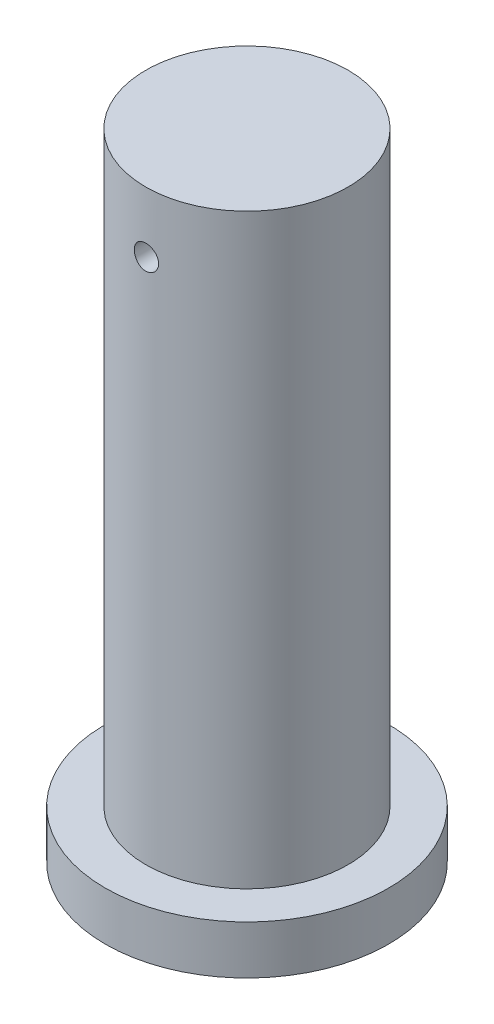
ISO-10303-21;
HEADER;
FILE_DESCRIPTION(('STEP AP214'),'2;1');
FILE_NAME('part.step','',(''),(''),'','','');
FILE_SCHEMA(('AUTOMOTIVE_DESIGN { 1 0 10303 214 1 1 1 1 }'));
ENDSEC;
DATA;
#1=APPLICATION_CONTEXT('core data for automotive mechanical design processes');
#2=APPLICATION_PROTOCOL_DEFINITION('international standard','automotive_design',2000,#1);
#3=PRODUCT_CONTEXT('',#1,'mechanical');
#4=PRODUCT('Part','Part','',(#3));
#5=PRODUCT_RELATED_PRODUCT_CATEGORY('part','',(#4));
#6=PRODUCT_DEFINITION_FORMATION('','',#4);
#7=PRODUCT_DEFINITION_CONTEXT('part definition',#1,'design');
#8=PRODUCT_DEFINITION('design','',#6,#7);
#9=PRODUCT_DEFINITION_SHAPE('','',#8);
#10=(LENGTH_UNIT() NAMED_UNIT(*) SI_UNIT(.MILLI.,.METRE.));
#11=(NAMED_UNIT(*) PLANE_ANGLE_UNIT() SI_UNIT($,.RADIAN.));
#12=(NAMED_UNIT(*) SI_UNIT($,.STERADIAN.) SOLID_ANGLE_UNIT());
#13=UNCERTAINTY_MEASURE_WITH_UNIT(LENGTH_MEASURE(1.E-05),#10,'distance_accuracy_value','');
#14=(GEOMETRIC_REPRESENTATION_CONTEXT(3) GLOBAL_UNCERTAINTY_ASSIGNED_CONTEXT((#13)) GLOBAL_UNIT_ASSIGNED_CONTEXT((#10,
#11,#12)) REPRESENTATION_CONTEXT('',''));
#15=CARTESIAN_POINT('',(0.,0.,0.));
#16=DIRECTION('',(0.,0.,1.));
#17=DIRECTION('',(1.,0.,0.));
#18=AXIS2_PLACEMENT_3D('',#15,#16,#17);
#19=CARTESIAN_POINT('',(0.,0.,25.));
#20=DIRECTION('',(0.,1.,0.));
#21=DIRECTION('',(0.,0.,1.));
#22=AXIS2_PLACEMENT_3D('',#19,#20,#21);
#23=PLANE('',#22);
#24=CARTESIAN_POINT('',(0.,0.,0.));
#25=DIRECTION('',(0.,1.,0.));
#26=DIRECTION('',(0.,0.,1.));
#27=AXIS2_PLACEMENT_3D('',#24,#25,#26);
#28=CIRCLE('',#27,25.);
#29=CARTESIAN_POINT('',(0.,0.,25.));
#30=VERTEX_POINT('',#29);
#31=EDGE_CURVE('E91',#30,#30,#28,.T.);
#32=ORIENTED_EDGE('',*,*,#31,.T.);
#33=EDGE_LOOP('',(#32));
#34=FACE_BOUND('',#33,.T.);
#35=ADVANCED_FACE('F41',(#34),#23,.T.);
#36=CARTESIAN_POINT('',(0.,-157.,0.));
#37=DIRECTION('',(0.,-1.,0.));
#38=DIRECTION('',(0.,0.,-1.));
#39=AXIS2_PLACEMENT_3D('',#36,#37,#38);
#40=PLANE('',#39);
#41=CARTESIAN_POINT('',(0.,-157.,0.));
#42=DIRECTION('',(0.,1.,0.));
#43=DIRECTION('',(0.,0.,1.));
#44=AXIS2_PLACEMENT_3D('',#41,#42,#43);
#45=CIRCLE('',#44,35.);
#46=CARTESIAN_POINT('',(0.,-157.,35.));
#47=VERTEX_POINT('',#46);
#48=EDGE_CURVE('E10',#47,#47,#45,.T.);
#49=ORIENTED_EDGE('',*,*,#48,.F.);
#50=EDGE_LOOP('',(#49));
#51=FACE_BOUND('',#50,.T.);
#52=ADVANCED_FACE('F82',(#51),#40,.T.);
#53=CARTESIAN_POINT('',(0.,0.,0.));
#54=DIRECTION('',(0.,1.,0.));
#55=DIRECTION('',(0.,0.,1.));
#56=AXIS2_PLACEMENT_3D('',#53,#54,#55);
#57=CYLINDRICAL_SURFACE('',#56,35.);
#58=ORIENTED_EDGE('',*,*,#48,.T.);
#59=EDGE_LOOP('',(#58));
#60=FACE_BOUND('',#59,.T.);
#61=CARTESIAN_POINT('',(0.,-145.,0.));
#62=DIRECTION('',(0.,1.,0.));
#63=DIRECTION('',(0.,0.,1.));
#64=AXIS2_PLACEMENT_3D('',#61,#62,#63);
#65=CIRCLE('',#64,35.);
#66=CARTESIAN_POINT('',(0.,-145.,35.));
#67=VERTEX_POINT('',#66);
#68=EDGE_CURVE('E53',#67,#67,#65,.T.);
#69=ORIENTED_EDGE('',*,*,#68,.F.);
#70=EDGE_LOOP('',(#69));
#71=FACE_BOUND('',#70,.T.);
#72=ADVANCED_FACE('F87',(#60,#71),#57,.T.);
#73=CARTESIAN_POINT('',(0.,-145.,35.));
#74=DIRECTION('',(0.,1.,0.));
#75=DIRECTION('',(0.,0.,1.));
#76=AXIS2_PLACEMENT_3D('',#73,#74,#75);
#77=PLANE('',#76);
#78=ORIENTED_EDGE('',*,*,#68,.T.);
#79=EDGE_LOOP('',(#78));
#80=FACE_BOUND('',#79,.T.);
#81=CARTESIAN_POINT('',(0.,-145.,0.));
#82=DIRECTION('',(0.,1.,0.));
#83=DIRECTION('',(0.,0.,1.));
#84=AXIS2_PLACEMENT_3D('',#81,#82,#83);
#85=CIRCLE('',#84,25.);
#86=CARTESIAN_POINT('',(0.,-145.,25.));
#87=VERTEX_POINT('',#86);
#88=EDGE_CURVE('E58',#87,#87,#85,.T.);
#89=ORIENTED_EDGE('',*,*,#88,.F.);
#90=EDGE_LOOP('',(#89));
#91=FACE_BOUND('',#90,.T.);
#92=ADVANCED_FACE('F77',(#80,#91),#77,.T.);
#93=CARTESIAN_POINT('',(0.,0.,0.));
#94=DIRECTION('',(0.,1.,0.));
#95=DIRECTION('',(0.,0.,1.));
#96=AXIS2_PLACEMENT_3D('',#93,#94,#95);
#97=CYLINDRICAL_SURFACE('',#96,25.);
#98=CARTESIAN_POINT('',(0.,-18.,25.));
#99=CARTESIAN_POINT('',(0.1678640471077,-17.9999928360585,24.9999977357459));
#100=CARTESIAN_POINT('',(0.335834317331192,-17.9858633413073,24.9982914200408));
#101=CARTESIAN_POINT('',(0.66710457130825,-17.9297189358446,24.991648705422));
#102=CARTESIAN_POINT('',(0.830399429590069,-17.8876745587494,24.9867088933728));
#103=CARTESIAN_POINT('',(1.14747479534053,-17.7769537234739,24.9741559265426));
#104=CARTESIAN_POINT('',(1.30126148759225,-17.7082947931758,24.9665445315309));
#105=CARTESIAN_POINT('',(1.595099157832,-17.5463312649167,24.9494959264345));
#106=CARTESIAN_POINT('',(1.73515256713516,-17.4530310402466,24.9400590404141));
#107=CARTESIAN_POINT('',(1.99829131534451,-17.2439251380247,24.920360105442));
#108=CARTESIAN_POINT('',(2.1212966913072,-17.128019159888,24.9100945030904));
#109=CARTESIAN_POINT('',(2.34615931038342,-16.8772070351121,24.8899239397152));
#110=CARTESIAN_POINT('',(2.44801549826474,-16.7422999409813,24.8800189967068));
#111=CARTESIAN_POINT('',(2.62798342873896,-16.4567991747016,24.8616560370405));
#112=CARTESIAN_POINT('',(2.7060207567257,-16.3061582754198,24.8532025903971));
#113=CARTESIAN_POINT('',(2.8356605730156,-15.9937912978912,24.8387461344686));
#114=CARTESIAN_POINT('',(2.88726398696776,-15.8320656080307,24.8327430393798));
#115=CARTESIAN_POINT('',(2.962329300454,-15.5029471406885,24.8239006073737));
#116=CARTESIAN_POINT('',(2.98592577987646,-15.3355854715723,24.8210461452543));
#117=CARTESIAN_POINT('',(3.0047237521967,-14.9992550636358,24.8187777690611));
#118=CARTESIAN_POINT('',(2.99992630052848,-14.830286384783,24.8193637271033));
#119=CARTESIAN_POINT('',(2.96218316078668,-14.4964740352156,24.8238961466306));
#120=CARTESIAN_POINT('',(2.92938543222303,-14.3316133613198,24.8278249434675));
#121=CARTESIAN_POINT('',(2.83680346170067,-14.0097529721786,24.8385728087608));
#122=CARTESIAN_POINT('',(2.77701871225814,-13.852753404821,24.8453919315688));
#123=CARTESIAN_POINT('',(2.63199980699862,-13.5506105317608,24.8611722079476));
#124=CARTESIAN_POINT('',(2.54670106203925,-13.4054985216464,24.8701387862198));
#125=CARTESIAN_POINT('',(2.35312173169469,-13.1315927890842,24.8891993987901));
#126=CARTESIAN_POINT('',(2.24484017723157,-13.0027997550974,24.8992934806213));
#127=CARTESIAN_POINT('',(2.0075475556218,-12.7643289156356,24.9195503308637));
#128=CARTESIAN_POINT('',(1.87840890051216,-12.6547780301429,24.929713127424));
#129=CARTESIAN_POINT('',(1.60350795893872,-12.4588884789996,24.9489020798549));
#130=CARTESIAN_POINT('',(1.45774563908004,-12.3725498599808,24.9579282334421));
#131=CARTESIAN_POINT('',(1.15363930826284,-12.2255367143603,24.9738318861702));
#132=CARTESIAN_POINT('',(0.995291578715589,-12.1648698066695,24.9807087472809));
#133=CARTESIAN_POINT('',(0.670556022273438,-12.0710212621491,24.991533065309));
#134=CARTESIAN_POINT('',(0.504168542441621,-12.0378384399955,24.9954806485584));
#135=CARTESIAN_POINT('',(0.169174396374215,-12.0000637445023,24.9999852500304));
#136=CARTESIAN_POINT('',(0.000587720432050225,-11.9952969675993,25.0005630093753));
#137=CARTESIAN_POINT('',(-0.334982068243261,-12.0140285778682,24.9983187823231));
#138=CARTESIAN_POINT('',(-0.50196521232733,-12.0375264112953,24.9954968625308));
#139=CARTESIAN_POINT('',(-0.829074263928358,-12.111974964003,24.9867833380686));
#140=CARTESIAN_POINT('',(-0.989219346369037,-12.16284261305,24.9809010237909));
#141=CARTESIAN_POINT('',(-1.29870539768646,-12.2905007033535,24.9667255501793));
#142=CARTESIAN_POINT('',(-1.44804602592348,-12.36729196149,24.9584323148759));
#143=CARTESIAN_POINT('',(-1.73246717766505,-12.5450429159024,24.9403085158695));
#144=CARTESIAN_POINT('',(-1.86747628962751,-12.6461161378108,24.9304708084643));
#145=CARTESIAN_POINT('',(-2.11867625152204,-12.8694008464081,24.9103817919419));
#146=CARTESIAN_POINT('',(-2.23486641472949,-12.9916131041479,24.9001304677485));
#147=CARTESIAN_POINT('',(-2.44574795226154,-13.2544756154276,24.8803059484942));
#148=CARTESIAN_POINT('',(-2.54032363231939,-13.3952190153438,24.8707365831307));
#149=CARTESIAN_POINT('',(-2.70449314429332,-13.6906950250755,24.8534214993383));
#150=CARTESIAN_POINT('',(-2.77408744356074,-13.8454273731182,24.8456757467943));
#151=CARTESIAN_POINT('',(-2.88612996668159,-14.1641106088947,24.8329105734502));
#152=CARTESIAN_POINT('',(-2.92864420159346,-14.3280380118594,24.8278845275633));
#153=CARTESIAN_POINT('',(-2.98553272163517,-14.660768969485,24.8211085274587));
#154=CARTESIAN_POINT('',(-2.99990820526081,-14.8295723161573,24.8193584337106));
#155=CARTESIAN_POINT('',(-3.00009033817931,-15.1661127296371,24.819336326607));
#156=CARTESIAN_POINT('',(-2.98607873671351,-15.3338497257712,24.8210421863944));
#157=CARTESIAN_POINT('',(-2.93026848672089,-15.6645667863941,24.8276922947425));
#158=CARTESIAN_POINT('',(-2.88846982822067,-15.8275468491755,24.8326365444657));
#159=CARTESIAN_POINT('',(-2.77832739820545,-16.1441045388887,24.8451996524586));
#160=CARTESIAN_POINT('',(-2.70999165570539,-16.2976849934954,24.8528177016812));
#161=CARTESIAN_POINT('',(-2.5487328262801,-16.5912277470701,24.8698714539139));
#162=CARTESIAN_POINT('',(-2.45580952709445,-16.7311899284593,24.8793071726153));
#163=CARTESIAN_POINT('',(-2.24733689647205,-16.9944529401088,24.8990055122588));
#164=CARTESIAN_POINT('',(-2.1316520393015,-17.1176461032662,24.9092728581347));
#165=CARTESIAN_POINT('',(-1.88122093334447,-17.342942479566,24.9294354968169));
#166=CARTESIAN_POINT('',(-1.74647018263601,-17.4450406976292,24.939330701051));
#167=CARTESIAN_POINT('',(-1.46119322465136,-17.6255505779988,24.9576721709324));
#168=CARTESIAN_POINT('',(-1.31061323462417,-17.7038777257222,24.966113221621));
#169=CARTESIAN_POINT('',(-0.998422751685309,-17.8340237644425,24.9805418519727));
#170=CARTESIAN_POINT('',(-0.836824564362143,-17.8858716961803,24.9865321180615));
#171=CARTESIAN_POINT('',(-0.561977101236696,-17.9490634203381,24.9939268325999));
#172=CARTESIAN_POINT('',(-0.450466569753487,-17.9681374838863,24.996193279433));
#173=CARTESIAN_POINT('',(-0.225986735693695,-17.9936081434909,24.9992306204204));
#174=CARTESIAN_POINT('',(-0.113017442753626,-18.0000048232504,25.0000015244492));
#175=CARTESIAN_POINT('',(0.,-18.,25.));
#176=B_SPLINE_CURVE_WITH_KNOTS('',3,(#98,#99,#100,#101,#102,#103,#104,#105,#106,#107,#108,#109,
#110,#111,#112,#113,#114,#115,#116,#117,#118,#119,#120,#121,#122,#123,#124,#125,#126,#127,#128,
#129,#130,#131,#132,#133,#134,#135,#136,#137,#138,#139,#140,#141,#142,#143,#144,#145,#146,#147,
#148,#149,#150,#151,#152,#153,#154,#155,#156,#157,#158,#159,#160,#161,#162,#163,#164,#165,#166,
#167,#168,#169,#170,#171,#172,#173,#174,#175),.UNSPECIFIED.,.T.,.F.,(4,2,2,2,2,2,2,2,2,2,2,2,2,
2,2,2,2,2,2,2,2,2,2,2,2,2,2,2,2,2,2,2,2,2,2,2,2,2,4),(0.,0.50317935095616,1.00689069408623,
1.5102708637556,2.01356175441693,2.51913872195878,3.02474090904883,3.53190689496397,
4.03905511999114,4.54375638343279,5.0484388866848,5.55047092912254,6.05251241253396,
6.55583573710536,7.05918028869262,7.56572944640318,8.07227962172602,8.57898002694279,
9.0856585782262,9.58921522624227,10.0927620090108,10.5947890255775,11.0968318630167,
11.6012692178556,12.1057249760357,12.6128207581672,13.119907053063,13.6257524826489,
14.1315763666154,14.6341719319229,15.1367676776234,15.6392114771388,16.1416596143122,
16.6471952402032,17.1528504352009,17.6602829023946,18.1671576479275,18.5059342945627,
18.8447087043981),.UNSPECIFIED.);
#177=CARTESIAN_POINT('',(0.,-18.,25.));
#178=VERTEX_POINT('',#177);
#179=EDGE_CURVE('E44',#178,#178,#176,.T.);
#180=ORIENTED_EDGE('',*,*,#179,.F.);
#181=EDGE_LOOP('',(#180));
#182=FACE_BOUND('',#181,.T.);
#183=CARTESIAN_POINT('',(3.,-15.,-24.8193472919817));
#184=CARTESIAN_POINT('',(2.99999283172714,-15.1678591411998,-24.8193496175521));
#185=CARTESIAN_POINT('',(2.98586413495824,-15.3358245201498,-24.8210685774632));
#186=CARTESIAN_POINT('',(2.92972318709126,-15.6670846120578,-24.8277564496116));
#187=CARTESIAN_POINT('',(2.88768145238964,-15.8303741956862,-24.8327287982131));
#188=CARTESIAN_POINT('',(2.77696834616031,-16.1474384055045,-24.8453523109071));
#189=CARTESIAN_POINT('',(2.708314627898,-16.3012192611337,-24.8530016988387));
#190=CARTESIAN_POINT('',(2.5463633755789,-16.5950471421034,-24.8701152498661));
#191=CARTESIAN_POINT('',(2.45307020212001,-16.7350965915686,-24.8795790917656));
#192=CARTESIAN_POINT('',(2.24397143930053,-16.9982397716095,-24.8993100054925));
#193=CARTESIAN_POINT('',(2.1280639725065,-17.1212522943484,-24.9095805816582));
#194=CARTESIAN_POINT('',(1.87724586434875,-17.346128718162,-24.9297361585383));
#195=CARTESIAN_POINT('',(1.74233429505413,-17.4479915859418,-24.9396211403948));
#196=CARTESIAN_POINT('',(1.45682956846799,-17.6279665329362,-24.9579274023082));
#197=CARTESIAN_POINT('',(1.30618995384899,-17.7060054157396,-24.9663441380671));
#198=CARTESIAN_POINT('',(0.993825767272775,-17.8356484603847,-24.9807271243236));
#199=CARTESIAN_POINT('',(0.832101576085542,-17.8872535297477,-24.9866934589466));
#200=CARTESIAN_POINT('',(0.502987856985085,-17.9623222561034,-24.9954787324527));
#201=CARTESIAN_POINT('',(0.335629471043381,-17.9859206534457,-24.9983127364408));
#202=CARTESIAN_POINT('',(-0.000694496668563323,-18.0047235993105,-25.0005654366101));
#203=CARTESIAN_POINT('',(-0.169660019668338,-17.9999291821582,-24.9999842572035));
#204=CARTESIAN_POINT('',(-0.503485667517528,-17.9621908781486,-24.9954842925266));
#205=CARTESIAN_POINT('',(-0.668362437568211,-17.9293918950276,-24.9915826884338));
#206=CARTESIAN_POINT('',(-0.990254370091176,-17.836801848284,-24.9808996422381));
#207=CARTESIAN_POINT('',(-1.1472693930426,-17.7770103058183,-24.9741181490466));
#208=CARTESIAN_POINT('',(-1.44943112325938,-17.6319772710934,-24.9584077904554));
#209=CARTESIAN_POINT('',(-1.59454729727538,-17.5466727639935,-24.9494736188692));
#210=CARTESIAN_POINT('',(-1.86845892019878,-17.3530811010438,-24.9304580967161));
#211=CARTESIAN_POINT('',(-1.99725367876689,-17.2447929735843,-24.9203766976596));
#212=CARTESIAN_POINT('',(-2.23571721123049,-17.0074956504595,-24.9001206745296));
#213=CARTESIAN_POINT('',(-2.34526038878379,-16.8783602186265,-24.8899458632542));
#214=CARTESIAN_POINT('',(-2.54113591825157,-16.6034684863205,-24.8707126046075));
#215=CARTESIAN_POINT('',(-2.62746820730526,-16.4577121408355,-24.8616541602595));
#216=CARTESIAN_POINT('',(-2.77447678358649,-16.1536075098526,-24.8456792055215));
#217=CARTESIAN_POINT('',(-2.83514351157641,-15.9952545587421,-24.8387634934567));
#218=CARTESIAN_POINT('',(-2.92899010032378,-15.6705076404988,-24.8278728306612));
#219=CARTESIAN_POINT('',(-2.96217117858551,-15.5041140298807,-24.8238977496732));
#220=CARTESIAN_POINT('',(-2.99993928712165,-15.1691169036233,-24.8193620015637));
#221=CARTESIAN_POINT('',(-3.00470284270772,-15.0005335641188,-24.8187802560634));
#222=CARTESIAN_POINT('',(-2.98596598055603,-14.664971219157,-24.8210413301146));
#223=CARTESIAN_POINT('',(-2.96246611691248,-14.4979921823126,-24.8238840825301));
#224=CARTESIAN_POINT('',(-2.88801791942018,-14.170904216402,-24.8326546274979));
#225=CARTESIAN_POINT('',(-2.83715462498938,-14.0107756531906,-24.8385728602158));
#226=CARTESIAN_POINT('',(-2.70951076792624,-13.701320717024,-24.8528197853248));
#227=CARTESIAN_POINT('',(-2.63272936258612,-13.5519946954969,-24.8611485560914));
#228=CARTESIAN_POINT('',(-2.45499302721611,-13.2675837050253,-24.8793287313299));
#229=CARTESIAN_POINT('',(-2.35392207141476,-13.1325717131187,-24.8891873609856));
#230=CARTESIAN_POINT('',(-2.13064017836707,-12.8813648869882,-24.9092935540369));
#231=CARTESIAN_POINT('',(-2.0084284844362,-12.7651707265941,-24.9195411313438));
#232=CARTESIAN_POINT('',(-1.74556427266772,-12.554280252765,-24.939335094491));
#233=CARTESIAN_POINT('',(-1.60481849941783,-12.4596997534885,-24.9488775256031));
#234=CARTESIAN_POINT('',(-1.30933642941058,-12.2955217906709,-24.966127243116));
#235=CARTESIAN_POINT('',(-1.15460039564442,-12.2259238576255,-24.9738345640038));
#236=CARTESIAN_POINT('',(-0.835919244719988,-12.1138789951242,-24.9865280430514));
#237=CARTESIAN_POINT('',(-0.671998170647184,-12.0713644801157,-24.9915209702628));
#238=CARTESIAN_POINT('',(-0.339280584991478,-12.0144732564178,-24.9982511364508));
#239=CARTESIAN_POINT('',(-0.170484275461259,-12.0000953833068,-24.9999885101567));
#240=CARTESIAN_POINT('',(0.166060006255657,-11.9999061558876,-25.0000113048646));
#241=CARTESIAN_POINT('',(0.333807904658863,-12.0139159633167,-24.9983183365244));
#242=CARTESIAN_POINT('',(0.664547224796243,-12.0697264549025,-24.9917135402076));
#243=CARTESIAN_POINT('',(0.827538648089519,-12.1115271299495,-24.9868017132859));
#244=CARTESIAN_POINT('',(1.14411955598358,-12.2216780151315,-24.9743088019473));
#245=CARTESIAN_POINT('',(1.29771180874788,-12.2900203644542,-24.9667285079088));
#246=CARTESIAN_POINT('',(1.59127541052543,-12.4512960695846,-24.9497392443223));
#247=CARTESIAN_POINT('',(1.73124664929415,-12.5442296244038,-24.9403302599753));
#248=CARTESIAN_POINT('',(1.99450948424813,-12.7527136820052,-24.920663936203));
#249=CARTESIAN_POINT('',(2.11769526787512,-12.8683973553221,-24.910401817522));
#250=CARTESIAN_POINT('',(2.34297730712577,-13.118823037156,-24.8902246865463));
#251=CARTESIAN_POINT('',(2.44506854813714,-13.2535695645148,-24.88030975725));
#252=CARTESIAN_POINT('',(2.62557074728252,-13.538842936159,-24.8619119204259));
#253=CARTESIAN_POINT('',(2.70389598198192,-13.6894243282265,-24.8534342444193));
#254=CARTESIAN_POINT('',(2.8340380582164,-14.001617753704,-24.8389322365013));
#255=CARTESIAN_POINT('',(2.88588396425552,-14.1632174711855,-24.8329052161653));
#256=CARTESIAN_POINT('',(2.94907010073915,-14.4380595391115,-24.8254627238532));
#257=CARTESIAN_POINT('',(2.96814164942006,-14.5495627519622,-24.8231807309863));
#258=CARTESIAN_POINT('',(2.99360896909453,-14.7740279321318,-24.8201222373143));
#259=CARTESIAN_POINT('',(3.00000482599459,-14.8869898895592,-24.8193457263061));
#260=CARTESIAN_POINT('',(3.,-15.,-24.8193472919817));
#261=B_SPLINE_CURVE_WITH_KNOTS('',3,(#183,#184,#185,#186,#187,#188,#189,#190,#191,#192,#193,
#194,#195,#196,#197,#198,#199,#200,#201,#202,#203,#204,#205,#206,#207,#208,#209,#210,#211,#212,
#213,#214,#215,#216,#217,#218,#219,#220,#221,#222,#223,#224,#225,#226,#227,#228,#229,#230,#231,
#232,#233,#234,#235,#236,#237,#238,#239,#240,#241,#242,#243,#244,#245,#246,#247,#248,#249,#250,
#251,#252,#253,#254,#255,#256,#257,#258,#259,#260),.UNSPECIFIED.,.T.,.F.,(4,2,2,2,2,2,2,2,2,2,2,
2,2,2,2,2,2,2,2,2,2,2,2,2,2,2,2,2,2,2,2,2,2,2,2,2,2,2,4),(0.,0.503164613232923,1.00686154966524,
1.51022492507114,2.01349927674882,2.51909553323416,3.02471648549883,3.53187561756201,
4.03901733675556,4.54370917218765,5.04838262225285,5.5504604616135,6.05254720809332,
6.55588445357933,7.05924298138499,7.56577244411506,8.0723032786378,8.5790226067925,
9.08571948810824,9.58926554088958,10.0928017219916,10.5947819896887,11.0967785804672,
11.6012225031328,12.105684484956,12.6127892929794,13.119884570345,13.6257094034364,
14.1315133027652,14.6341406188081,15.1367677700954,15.6392461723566,16.1417286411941,
16.6472450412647,17.1528814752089,17.6603206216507,18.1672015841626,18.5059562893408,
18.8447086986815),.UNSPECIFIED.);
#262=CARTESIAN_POINT('',(3.,-15.,-24.8193472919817));
#263=VERTEX_POINT('',#262);
#264=EDGE_CURVE('E61',#263,#263,#261,.T.);
#265=ORIENTED_EDGE('',*,*,#264,.F.);
#266=EDGE_LOOP('',(#265));
#267=FACE_BOUND('',#266,.T.);
#268=ORIENTED_EDGE('',*,*,#88,.T.);
#269=EDGE_LOOP('',(#268));
#270=FACE_BOUND('',#269,.T.);
#271=ORIENTED_EDGE('',*,*,#31,.F.);
#272=EDGE_LOOP('',(#271));
#273=FACE_BOUND('',#272,.T.);
#274=ADVANCED_FACE('F66',(#182,#267,#270,#273),#97,.T.);
#275=CARTESIAN_POINT('',(0.,-15.,-35.));
#276=DIRECTION('',(0.,0.,1.));
#277=DIRECTION('',(1.,0.,0.));
#278=AXIS2_PLACEMENT_3D('',#275,#276,#277);
#279=CYLINDRICAL_SURFACE('',#278,3.);
#280=ORIENTED_EDGE('',*,*,#179,.T.);
#281=EDGE_LOOP('',(#280));
#282=FACE_BOUND('',#281,.T.);
#283=ORIENTED_EDGE('',*,*,#264,.T.);
#284=EDGE_LOOP('',(#283));
#285=FACE_BOUND('',#284,.T.);
#286=ADVANCED_FACE('F69',(#282,#285),#279,.F.);
#287=CLOSED_SHELL('',(#35,#52,#72,#92,#274,#286));
#288=MANIFOLD_SOLID_BREP('B2',#287);
#289=ADVANCED_BREP_SHAPE_REPRESENTATION('',(#18,#288),#14);
#290=SHAPE_DEFINITION_REPRESENTATION(#9,#289);
ENDSEC;
END-ISO-10303-21;
